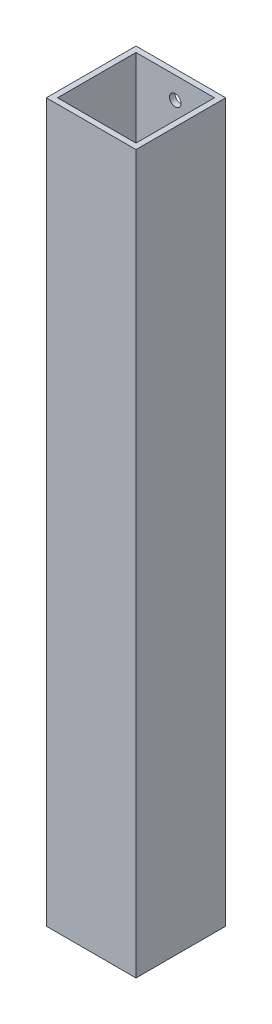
from build123d import *

# Parameters (mm, degrees)
SKETCH1_W           = 25.4
SKETCH1_H           = 25.4
SKETCH1_W_2         = 22.225
SKETCH1_H_2         = 22.225
BOSS_EXTRUDE1_DEPTH = 203.2
SKETCH2_R           = 1.63195
CUT_EXTRUDE1_DEPTH  = 1.5875


with BuildPart() as part:
    # Sketch1 → Boss-Extrude1 (new body)
    with BuildSketch(Plane(origin=(0, 0, 0), x_dir=(1, 0, 0), z_dir=(0, 1, 0))):
        Rectangle(SKETCH1_W, SKETCH1_H)
        Rectangle(SKETCH1_W_2, SKETCH1_H_2, mode=Mode.SUBTRACT)
    extrude(amount=BOSS_EXTRUDE1_DEPTH)

    # Sketch2 → Cut-Extrude1 (cut)
    with BuildSketch(Plane(origin=(0, 0, -12.7), x_dir=(-1, 0, 0), z_dir=(0, 0, -1))):
        with Locations((0, 146.247703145)):
            Circle(SKETCH2_R)
        with Locations((0, 171.647703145)):
            Circle(SKETCH2_R)
        with Locations((0, 197.047703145)):
            Circle(SKETCH2_R)
    extrude(amount=-CUT_EXTRUDE1_DEPTH, mode=Mode.SUBTRACT)


solid = part.part
